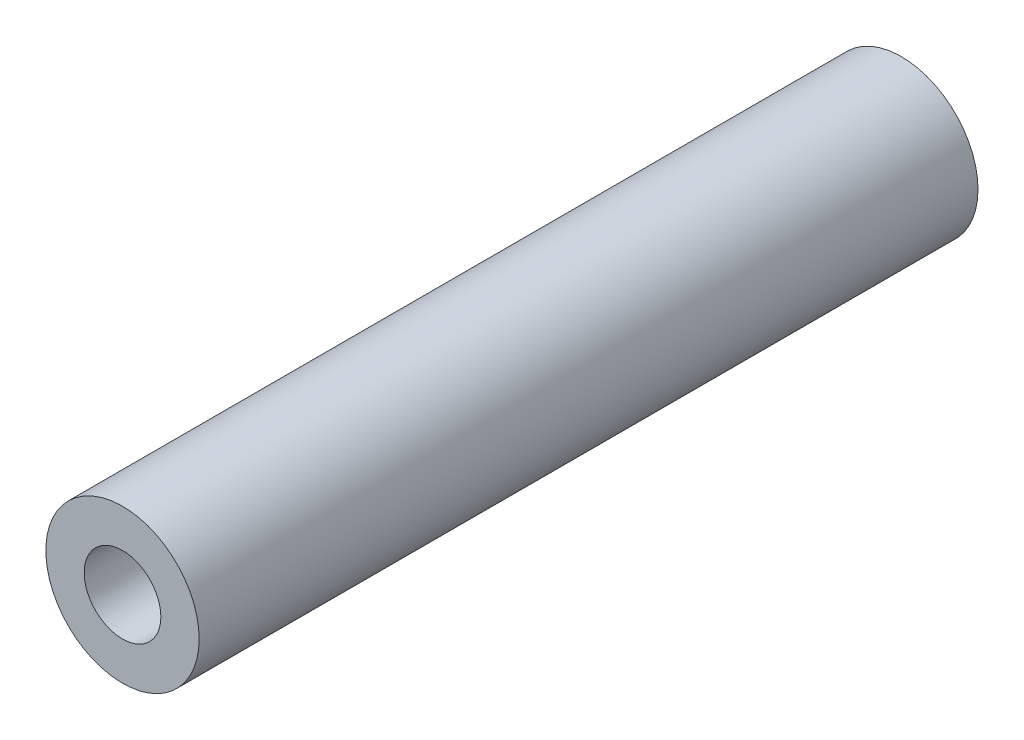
ISO-10303-21;
HEADER;
FILE_DESCRIPTION(('STEP AP214'),'2;1');
FILE_NAME('part.step','',(''),(''),'','','');
FILE_SCHEMA(('AUTOMOTIVE_DESIGN { 1 0 10303 214 1 1 1 1 }'));
ENDSEC;
DATA;
#1=APPLICATION_CONTEXT('core data for automotive mechanical design processes');
#2=APPLICATION_PROTOCOL_DEFINITION('international standard','automotive_design',2000,#1);
#3=PRODUCT_CONTEXT('',#1,'mechanical');
#4=PRODUCT('Part','Part','',(#3));
#5=PRODUCT_RELATED_PRODUCT_CATEGORY('part','',(#4));
#6=PRODUCT_DEFINITION_FORMATION('','',#4);
#7=PRODUCT_DEFINITION_CONTEXT('part definition',#1,'design');
#8=PRODUCT_DEFINITION('design','',#6,#7);
#9=PRODUCT_DEFINITION_SHAPE('','',#8);
#10=(LENGTH_UNIT() NAMED_UNIT(*) SI_UNIT(.MILLI.,.METRE.));
#11=(NAMED_UNIT(*) PLANE_ANGLE_UNIT() SI_UNIT($,.RADIAN.));
#12=(NAMED_UNIT(*) SI_UNIT($,.STERADIAN.) SOLID_ANGLE_UNIT());
#13=UNCERTAINTY_MEASURE_WITH_UNIT(LENGTH_MEASURE(1.E-05),#10,'distance_accuracy_value','');
#14=(GEOMETRIC_REPRESENTATION_CONTEXT(3) GLOBAL_UNCERTAINTY_ASSIGNED_CONTEXT((#13)) GLOBAL_UNIT_ASSIGNED_CONTEXT((#10,
#11,#12)) REPRESENTATION_CONTEXT('',''));
#15=CARTESIAN_POINT('',(0.,0.,0.));
#16=DIRECTION('',(0.,0.,1.));
#17=DIRECTION('',(1.,0.,0.));
#18=AXIS2_PLACEMENT_3D('',#15,#16,#17);
#19=CARTESIAN_POINT('',(0.,0.,254.));
#20=DIRECTION('',(0.,0.,1.));
#21=DIRECTION('',(1.,0.,0.));
#22=AXIS2_PLACEMENT_3D('',#19,#20,#21);
#23=PLANE('',#22);
#24=CARTESIAN_POINT('',(0.,0.,254.));
#25=DIRECTION('',(0.,0.,1.));
#26=DIRECTION('',(1.,0.,0.));
#27=AXIS2_PLACEMENT_3D('',#24,#25,#26);
#28=CIRCLE('',#27,25.);
#29=CARTESIAN_POINT('',(25.,0.,254.));
#30=VERTEX_POINT('',#29);
#31=EDGE_CURVE('E9',#30,#30,#28,.T.);
#32=ORIENTED_EDGE('',*,*,#31,.T.);
#33=EDGE_LOOP('',(#32));
#34=FACE_BOUND('',#33,.T.);
#35=CARTESIAN_POINT('',(0.,0.,254.));
#36=DIRECTION('',(0.,0.,1.));
#37=DIRECTION('',(1.,0.,0.));
#38=AXIS2_PLACEMENT_3D('',#35,#36,#37);
#39=CIRCLE('',#38,12.5);
#40=CARTESIAN_POINT('',(12.5,0.,254.));
#41=VERTEX_POINT('',#40);
#42=EDGE_CURVE('E25',#41,#41,#39,.T.);
#43=ORIENTED_EDGE('',*,*,#42,.F.);
#44=EDGE_LOOP('',(#43));
#45=FACE_BOUND('',#44,.T.);
#46=ADVANCED_FACE('F14',(#34,#45),#23,.T.);
#47=CARTESIAN_POINT('',(0.,0.,0.));
#48=DIRECTION('',(0.,0.,1.));
#49=DIRECTION('',(1.,0.,0.));
#50=AXIS2_PLACEMENT_3D('',#47,#48,#49);
#51=PLANE('',#50);
#52=CARTESIAN_POINT('',(0.,0.,0.));
#53=DIRECTION('',(0.,0.,1.));
#54=DIRECTION('',(1.,0.,0.));
#55=AXIS2_PLACEMENT_3D('',#52,#53,#54);
#56=CIRCLE('',#55,25.);
#57=CARTESIAN_POINT('',(25.,0.,0.));
#58=VERTEX_POINT('',#57);
#59=EDGE_CURVE('E18',#58,#58,#56,.T.);
#60=ORIENTED_EDGE('',*,*,#59,.F.);
#61=EDGE_LOOP('',(#60));
#62=FACE_BOUND('',#61,.T.);
#63=CARTESIAN_POINT('',(0.,0.,0.));
#64=DIRECTION('',(0.,0.,1.));
#65=DIRECTION('',(1.,0.,0.));
#66=AXIS2_PLACEMENT_3D('',#63,#64,#65);
#67=CIRCLE('',#66,12.5);
#68=CARTESIAN_POINT('',(12.5,0.,0.));
#69=VERTEX_POINT('',#68);
#70=EDGE_CURVE('E27',#69,#69,#67,.T.);
#71=ORIENTED_EDGE('',*,*,#70,.T.);
#72=EDGE_LOOP('',(#71));
#73=FACE_BOUND('',#72,.T.);
#74=ADVANCED_FACE('F37',(#62,#73),#51,.F.);
#75=CARTESIAN_POINT('',(0.,0.,254.));
#76=DIRECTION('',(0.,0.,-1.));
#77=DIRECTION('',(-1.,0.,0.));
#78=AXIS2_PLACEMENT_3D('',#75,#76,#77);
#79=CYLINDRICAL_SURFACE('',#78,25.);
#80=ORIENTED_EDGE('',*,*,#31,.F.);
#81=EDGE_LOOP('',(#80));
#82=FACE_BOUND('',#81,.T.);
#83=ORIENTED_EDGE('',*,*,#59,.T.);
#84=EDGE_LOOP('',(#83));
#85=FACE_BOUND('',#84,.T.);
#86=ADVANCED_FACE('F16',(#82,#85),#79,.T.);
#87=CARTESIAN_POINT('',(0.,0.,254.));
#88=DIRECTION('',(0.,0.,-1.));
#89=DIRECTION('',(-1.,0.,0.));
#90=AXIS2_PLACEMENT_3D('',#87,#88,#89);
#91=CYLINDRICAL_SURFACE('',#90,12.5);
#92=ORIENTED_EDGE('',*,*,#42,.T.);
#93=EDGE_LOOP('',(#92));
#94=FACE_BOUND('',#93,.T.);
#95=ORIENTED_EDGE('',*,*,#70,.F.);
#96=EDGE_LOOP('',(#95));
#97=FACE_BOUND('',#96,.T.);
#98=ADVANCED_FACE('F33',(#94,#97),#91,.F.);
#99=CLOSED_SHELL('',(#46,#74,#86,#98));
#100=MANIFOLD_SOLID_BREP('B1',#99);
#101=ADVANCED_BREP_SHAPE_REPRESENTATION('',(#18,#100),#14);
#102=SHAPE_DEFINITION_REPRESENTATION(#9,#101);
ENDSEC;
END-ISO-10303-21;
